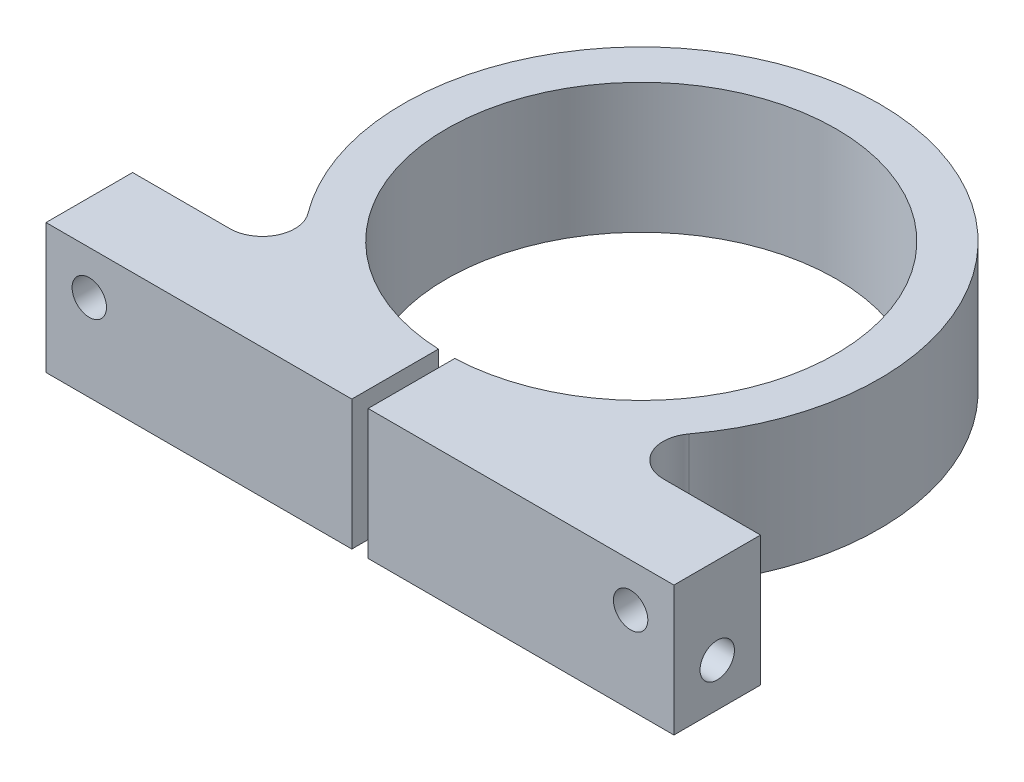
from build123d import *

# Parameters (mm, degrees)
EXTRUDE1_DEPTH          = 38.1
F_3_8_CLEARANCE_HOLE2_D = 10.0838
F_3_8_CLEARANCE_HOLE1_D = 10.0838
F_3_8_CLEARANCE_HOLE3_D = 10.0838


with BuildPart() as part:
    # Sketch1 → Extrude1 (new body)
    with BuildSketch(Plane(origin=(0, 0, 0), x_dir=(1, 0, 0), z_dir=(0, 1, 0))):
        with BuildLine():
            Line((2.3876, -82.500103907), (92.075, -82.500103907))
            Line((92.075, -82.500103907), (92.075, -57.100103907))
            Line((92.075, -57.100103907), (63.537391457, -57.100103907))
            ThreePointArc((63.537391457, -57.100103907), (55.019646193, -51.838159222), (55.912904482, -41.866091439))
            ThreePointArc((55.912904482, -41.866091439), (0, 69.85), (-55.912904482, -41.866091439))
            ThreePointArc((-55.912904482, -41.866091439), (-55.019646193, -51.838159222), (-63.537391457, -57.100103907))
            Line((-63.537391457, -57.100103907), (-92.075, -57.100103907))
            Line((-92.075, -57.100103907), (-92.075, -82.500103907))
            Line((-92.075, -82.500103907), (-2.3876, -82.500103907))
            Line((-2.3876, -82.500103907), (-2.3876, -57.100103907))
            ThreePointArc((-2.3876, -57.100103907), (0, 57.15), (2.3876, -57.100103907))
            Line((2.3876, -57.100103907), (2.3876, -82.500103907))
        make_face()
    extrude(amount=EXTRUDE1_DEPTH)

    # 3_8 Clearance Hole2 (through all)
    with Locations(Plane(origin=(-92.075, 12.7, 69.800103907), x_dir=(0, 0, -1), z_dir=(-1, 0, 0))):
        with Locations((0, 0)):
            Hole(F_3_8_CLEARANCE_HOLE2_D / 2)

    # 3_8 Clearance Hole1 (through all)
    with Locations(Plane(origin=(-79.375, 25.4, 57.100103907), x_dir=(-1, 0, 0), z_dir=(0, 0, -1))):
        with Locations((0, 0)):
            Hole(F_3_8_CLEARANCE_HOLE1_D / 2)

    # 3_8 Clearance Hole3 (through all)
    with Locations(Plane(origin=(79.375, 25.4, 57.100103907), x_dir=(-1, 0, 0), z_dir=(0, 0, -1))):
        with Locations((0, 0)):
            Hole(F_3_8_CLEARANCE_HOLE3_D / 2)


solid = part.part
